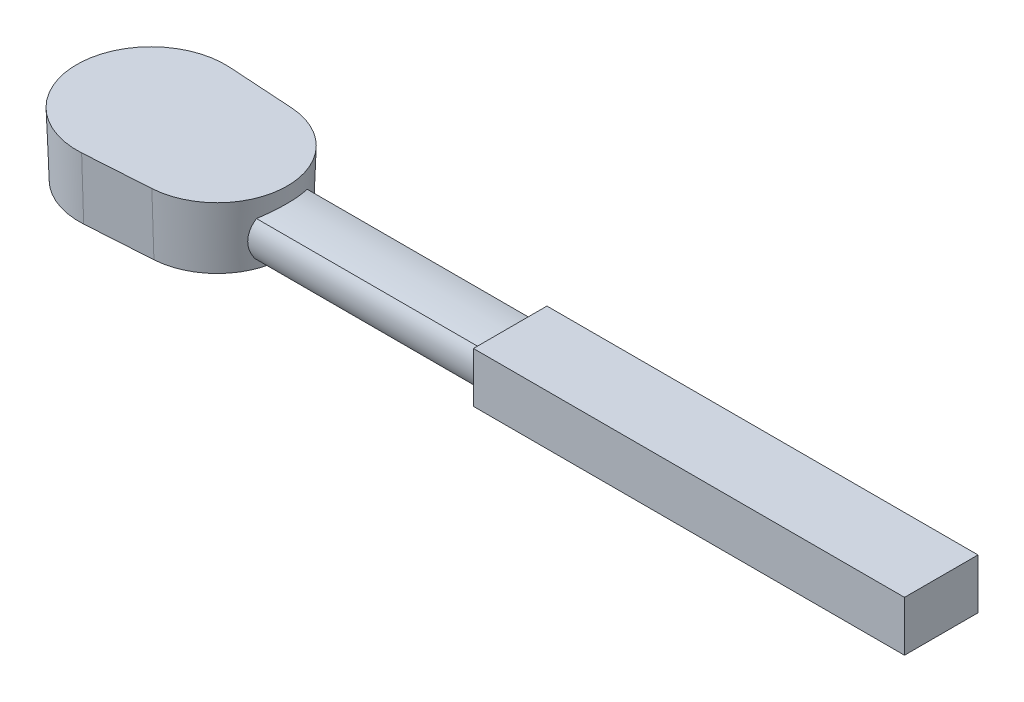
from build123d import *

# Parameters (mm, degrees)
EXTRUDE1_DEPTH = 44.45
EXTRUDE1_DRAFT = -2
EXTRUDE2_DEPTH = 254
SKETCH3_W      = 51.97462506
SKETCH3_H      = 35.46629128
EXTRUDE3_DEPTH = 304.8


with BuildPart() as part:
    # Sketch1 → Extrude1 (with draft: the straight prism first)
    with BuildSketch(Plane(origin=(0, 0, 0), x_dir=(1, 0, 0), z_dir=(0, 1, 0))):
        with BuildLine():
            ThreePointArc((3.248620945, 50.833960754), (-50.937658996, 0), (3.248620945, -50.833960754))
            Line((3.248620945, -50.833960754), (49.923032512, -47.851162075))
            ThreePointArc((49.923032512, -47.851162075), (94.813807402, 0), (49.923032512, 47.851162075))
            Line((49.923032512, 47.851162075), (3.248620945, 50.833960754))
        make_face()
    extrude(amount=EXTRUDE1_DEPTH)
    # Extrude1: the draft: its side faces are tilted about the plane it starts from
    extrude1_sides = [part.faces().sort_by_distance(p)[0] for p in [
        (26.585826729, 22.225, -49.342561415),
        (-50.937658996, 22.225, 0),
        (26.585826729, 22.225, 49.342561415),
        (94.813807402, 22.225, 0),
    ]]
    draft(extrude1_sides, Plane(origin=(0, 0, 0), x_dir=(1, 0, 0), z_dir=(0, 1, 0)), EXTRUDE1_DRAFT)

    # Sketch2 → Extrude2 (add)
    with BuildSketch(Plane(origin=(0, 0, 0), x_dir=(0, 0, -1), z_dir=(1, 0, 0))):
        with BuildLine():
            ThreePointArc((-17.930489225, 31.580371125), (-21.874931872, 19.05), (-17.930489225, 6.519628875))
            ThreePointArc((-17.930489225, 6.519628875), (0, 4.694168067), (17.930489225, 6.519628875))
            ThreePointArc((17.930489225, 6.519628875), (21.874931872, 19.05), (17.930489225, 31.580371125))
            ThreePointArc((17.930489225, 31.580371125), (0, 33.405831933), (-17.930489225, 31.580371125))
        make_face()
    extrude(amount=EXTRUDE2_DEPTH)

    # Sketch3 → Extrude3 (add)
    with BuildSketch(Plane(origin=(254, 0, 0), x_dir=(0, 0, -1), z_dir=(1, 0, 0))):
        with Locations((0, 19.05)):
            Rectangle(SKETCH3_W, SKETCH3_H)
    extrude(amount=EXTRUDE3_DEPTH)


solid = part.part
